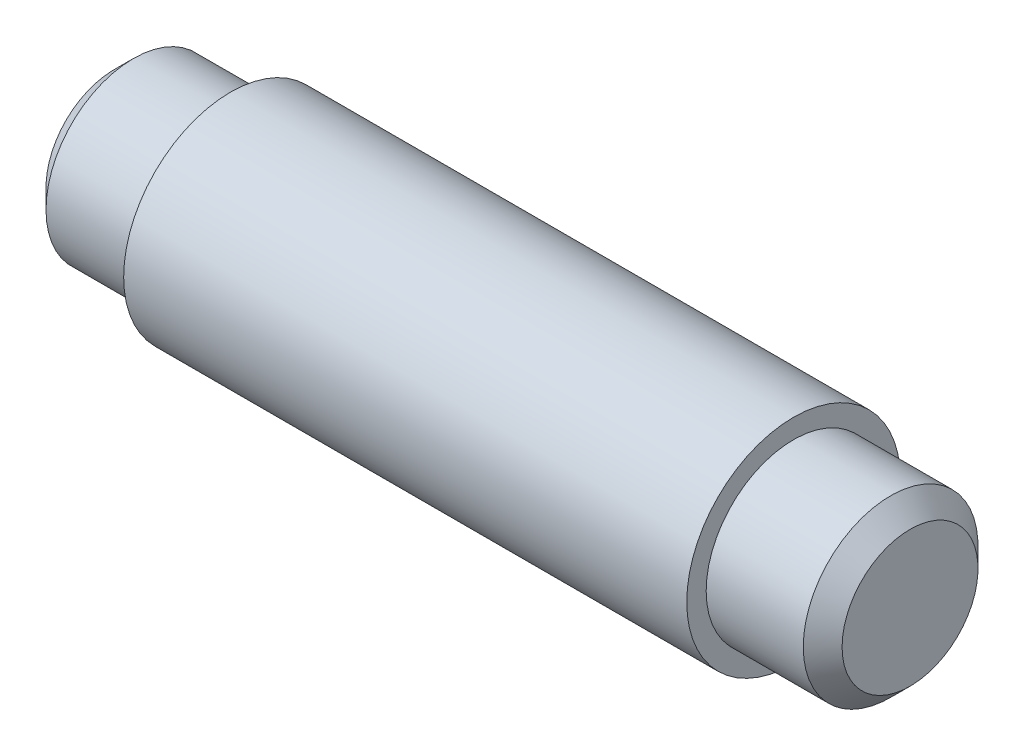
from build123d import *

# Parameters (mm, degrees)
CHAMFER1_SIZE = 2


with BuildPart() as part:
    # Sketch1 → Revolve1 (revolve)
    with BuildSketch(Plane.XY, mode=Mode.PRIVATE) as revolve1_sk:
        Polygon((-41, 0), (41, 0), (41, 9), (29, 9), (29, 11), (-29, 11), (-29, 9), (-41, 9), align=None)
    revolve(revolve1_sk.sketch.rotate(Axis((-41, 0, 0), (1, 0, 0)), 90), axis=Axis((-41, 0, 0), (1, 0, 0)))

    # Chamfer1
    chamfer1_edges = [part.edges().sort_by_distance(p)[0] for p in [
        (-41, 0, -9),
        (41, 0, -9),
    ]]
    chamfer(chamfer1_edges, length=CHAMFER1_SIZE)


solid = part.part
